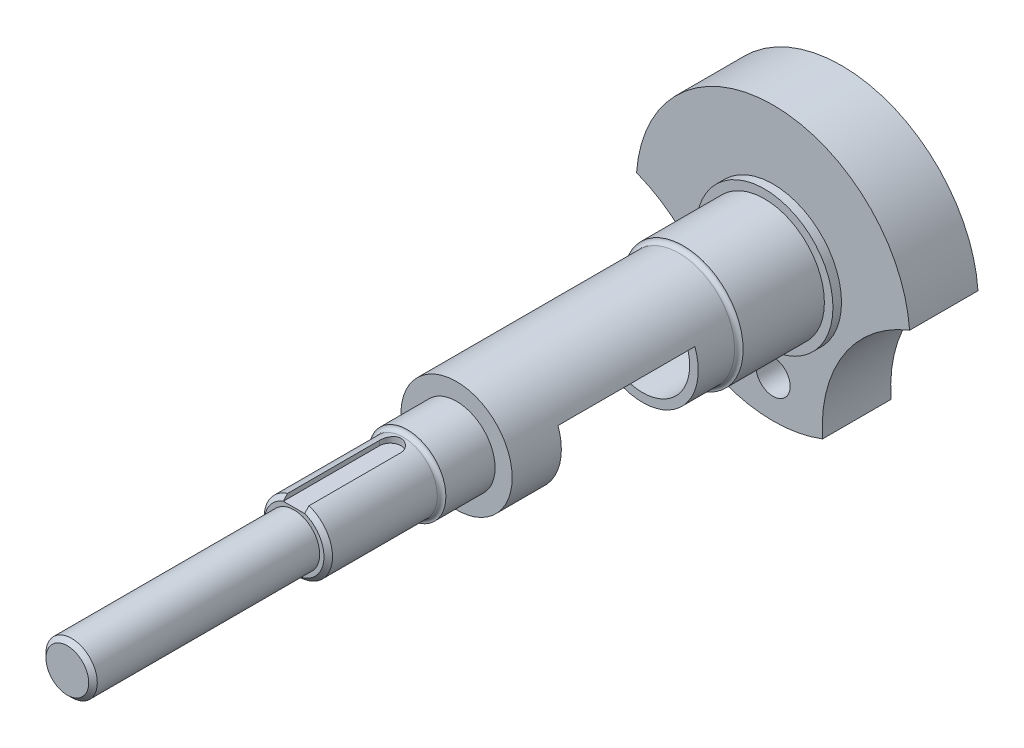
ISO-10303-21;
HEADER;
FILE_DESCRIPTION(('STEP AP214'),'2;1');
FILE_NAME('part.step','',(''),(''),'','','');
FILE_SCHEMA(('AUTOMOTIVE_DESIGN { 1 0 10303 214 1 1 1 1 }'));
ENDSEC;
DATA;
#1=APPLICATION_CONTEXT('core data for automotive mechanical design processes');
#2=APPLICATION_PROTOCOL_DEFINITION('international standard','automotive_design',2000,#1);
#3=PRODUCT_CONTEXT('',#1,'mechanical');
#4=PRODUCT('Part','Part','',(#3));
#5=PRODUCT_RELATED_PRODUCT_CATEGORY('part','',(#4));
#6=PRODUCT_DEFINITION_FORMATION('','',#4);
#7=PRODUCT_DEFINITION_CONTEXT('part definition',#1,'design');
#8=PRODUCT_DEFINITION('design','',#6,#7);
#9=PRODUCT_DEFINITION_SHAPE('','',#8);
#10=(LENGTH_UNIT() NAMED_UNIT(*) SI_UNIT(.MILLI.,.METRE.));
#11=(NAMED_UNIT(*) PLANE_ANGLE_UNIT() SI_UNIT($,.RADIAN.));
#12=(NAMED_UNIT(*) SI_UNIT($,.STERADIAN.) SOLID_ANGLE_UNIT());
#13=UNCERTAINTY_MEASURE_WITH_UNIT(LENGTH_MEASURE(1.E-05),#10,'distance_accuracy_value','');
#14=(GEOMETRIC_REPRESENTATION_CONTEXT(3) GLOBAL_UNCERTAINTY_ASSIGNED_CONTEXT((#13)) GLOBAL_UNIT_ASSIGNED_CONTEXT((#10,
#11,#12)) REPRESENTATION_CONTEXT('',''));
#15=CARTESIAN_POINT('',(0.,0.,0.));
#16=DIRECTION('',(0.,0.,1.));
#17=DIRECTION('',(1.,0.,0.));
#18=AXIS2_PLACEMENT_3D('',#15,#16,#17);
#19=CARTESIAN_POINT('',(0.,0.,64.));
#20=DIRECTION('',(0.,0.,-1.));
#21=DIRECTION('',(-1.,0.,0.));
#22=AXIS2_PLACEMENT_3D('',#19,#20,#21);
#23=CYLINDRICAL_SURFACE('',#22,4.);
#24=CARTESIAN_POINT('',(0.,0.,51.25));
#25=DIRECTION('',(0.,0.,1.));
#26=DIRECTION('',(1.,0.,0.));
#27=AXIS2_PLACEMENT_3D('',#24,#25,#26);
#28=CIRCLE('',#27,4.);
#29=CARTESIAN_POINT('',(4.,0.,51.25));
#30=VERTEX_POINT('',#29);
#31=EDGE_CURVE('E257',#30,#30,#28,.T.);
#32=ORIENTED_EDGE('',*,*,#31,.T.);
#33=EDGE_LOOP('',(#32));
#34=FACE_BOUND('',#33,.T.);
#35=DIRECTION('',(0.,0.,-1.));
#36=VECTOR('',#35,1.);
#37=CARTESIAN_POINT('',(-1.24999999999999,3.79967103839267,64.));
#38=LINE('',#37,#36);
#39=CARTESIAN_POINT('',(-1.24999999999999,3.79967103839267,52.75));
#40=VERTEX_POINT('',#39);
#41=CARTESIAN_POINT('',(-1.24999999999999,3.79967103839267,63.5));
#42=VERTEX_POINT('',#41);
#43=EDGE_CURVE('E167',#40,#42,#38,.F.);
#44=ORIENTED_EDGE('',*,*,#43,.F.);
#45=CARTESIAN_POINT('',(1.25,3.79967103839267,52.75));
#46=CARTESIAN_POINT('',(1.25000079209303,3.79966794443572,52.7157573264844));
#47=CARTESIAN_POINT('',(1.24859202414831,3.80013451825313,52.681531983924));
#48=CARTESIAN_POINT('',(1.24297859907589,3.80197544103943,52.6133440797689));
#49=CARTESIAN_POINT('',(1.23877461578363,3.80334957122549,52.5793814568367));
#50=CARTESIAN_POINT('',(1.22204347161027,3.80877341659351,52.4784451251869));
#51=CARTESIAN_POINT('',(1.20539672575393,3.81412503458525,52.4121759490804));
#52=CARTESIAN_POINT('',(1.16170105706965,3.82765800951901,52.2835553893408));
#53=CARTESIAN_POINT('',(1.13465653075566,3.83583817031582,52.2212023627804));
#54=CARTESIAN_POINT('',(1.07098191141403,3.85410064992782,52.1018698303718));
#55=CARTESIAN_POINT('',(1.03434683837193,3.86418395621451,52.0448931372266));
#56=CARTESIAN_POINT('',(0.951196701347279,3.88550108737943,51.9360211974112));
#57=CARTESIAN_POINT('',(0.904410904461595,3.89676086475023,51.8843378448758));
#58=CARTESIAN_POINT('',(0.80286383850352,3.91894210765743,51.7894056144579));
#59=CARTESIAN_POINT('',(0.748101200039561,3.92986351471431,51.7461581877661));
#60=CARTESIAN_POINT('',(0.630624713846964,3.95043574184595,51.6683880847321));
#61=CARTESIAN_POINT('',(0.567759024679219,3.96005223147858,51.6340849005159));
#62=CARTESIAN_POINT('',(0.436801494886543,3.97662579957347,51.5766230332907));
#63=CARTESIAN_POINT('',(0.368711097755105,3.98358360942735,51.5534612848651));
#64=CARTESIAN_POINT('',(0.231465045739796,3.99387170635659,51.5196490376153));
#65=CARTESIAN_POINT('',(0.162407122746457,3.99730732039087,51.5086344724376));
#66=CARTESIAN_POINT('',(0.023342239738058,4.0005359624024,51.4982756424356));
#67=CARTESIAN_POINT('',(-0.0466645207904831,4.00032974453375,51.4989289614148));
#68=CARTESIAN_POINT('',(-0.183074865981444,3.99637115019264,51.5116483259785));
#69=CARTESIAN_POINT('',(-0.249519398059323,3.99274146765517,51.5233195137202));
#70=CARTESIAN_POINT('',(-0.379453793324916,3.98249474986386,51.5570952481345));
#71=CARTESIAN_POINT('',(-0.442943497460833,3.97587755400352,51.5792003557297));
#72=CARTESIAN_POINT('',(-0.566078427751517,3.96023455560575,51.6334703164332));
#73=CARTESIAN_POINT('',(-0.625667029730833,3.95118023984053,51.6657550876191));
#74=CARTESIAN_POINT('',(-0.738703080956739,3.93161711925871,51.7393715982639));
#75=CARTESIAN_POINT('',(-0.792149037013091,3.92110796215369,51.7807055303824));
#76=CARTESIAN_POINT('',(-0.89373293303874,3.89923772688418,51.8732690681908));
#77=CARTESIAN_POINT('',(-0.94155771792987,3.88785939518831,51.9248387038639));
#78=CARTESIAN_POINT('',(-1.02798269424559,3.86590811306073,52.0353851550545));
#79=CARTESIAN_POINT('',(-1.06658010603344,3.85533540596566,52.0943641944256));
#80=CARTESIAN_POINT('',(-1.13382462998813,3.83610264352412,52.2189514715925));
#81=CARTESIAN_POINT('',(-1.16235013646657,3.82746639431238,52.2846291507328));
#82=CARTESIAN_POINT('',(-1.20780456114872,3.81336907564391,52.4201559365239));
#83=CARTESIAN_POINT('',(-1.22475139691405,3.80790310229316,52.4899984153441));
#84=CARTESIAN_POINT('',(-1.24039171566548,3.8028211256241,52.5920875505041));
#85=CARTESIAN_POINT('',(-1.24399403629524,3.80164270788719,52.6235724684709));
#86=CARTESIAN_POINT('',(-1.24879622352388,3.80006741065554,52.6866994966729));
#87=CARTESIAN_POINT('',(-1.2499994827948,3.79966942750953,52.7183413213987));
#88=CARTESIAN_POINT('',(-1.25,3.79967103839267,52.75));
#89=B_SPLINE_CURVE_WITH_KNOTS('',3,(#45,#46,#47,#48,#49,#50,#51,#52,#53,#54,#55,#56,#57,#58,#59,
#60,#61,#62,#63,#64,#65,#66,#67,#68,#69,#70,#71,#72,#73,#74,#75,#76,#77,#78,#79,#80,#81,#82,#83,
#84,#85,#86,#87,#88),.UNSPECIFIED.,.F.,.F.,(4,2,2,2,2,2,2,2,2,2,2,2,2,2,2,2,2,2,2,2,2,4),(0.,
0.102661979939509,0.205299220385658,0.409842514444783,0.614299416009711,0.818862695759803,
1.02975828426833,1.24069012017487,1.45639343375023,1.672037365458,1.88102599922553,
2.08997135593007,2.29170187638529,2.49344324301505,2.69765601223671,2.90191831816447,
3.11467479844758,3.32749528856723,3.54280388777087,3.75777854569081,3.85283052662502,
3.94774799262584),.UNSPECIFIED.);
#90=CARTESIAN_POINT('',(1.25000000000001,3.79967103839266,52.75));
#91=VERTEX_POINT('',#90);
#92=EDGE_CURVE('E11',#91,#40,#89,.T.);
#93=ORIENTED_EDGE('',*,*,#92,.F.);
#94=DIRECTION('',(0.,0.,-1.));
#95=VECTOR('',#94,1.);
#96=CARTESIAN_POINT('',(1.25000000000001,3.79967103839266,64.));
#97=LINE('',#96,#95);
#98=CARTESIAN_POINT('',(1.25000000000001,3.79967103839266,63.5));
#99=VERTEX_POINT('',#98);
#100=EDGE_CURVE('E144',#99,#91,#97,.T.);
#101=ORIENTED_EDGE('',*,*,#100,.F.);
#102=CARTESIAN_POINT('',(0.,0.,63.5));
#103=DIRECTION('',(0.,0.,1.));
#104=DIRECTION('',(1.,0.,0.));
#105=AXIS2_PLACEMENT_3D('',#102,#103,#104);
#106=CIRCLE('',#105,4.);
#107=EDGE_CURVE('E263',#99,#42,#106,.F.);
#108=ORIENTED_EDGE('',*,*,#107,.T.);
#109=EDGE_LOOP('',(#44,#93,#101,#108));
#110=FACE_BOUND('',#109,.T.);
#111=ADVANCED_FACE('F32',(#34,#110),#23,.T.);
#112=CARTESIAN_POINT('',(0.,0.,64.));
#113=DIRECTION('',(0.,0.,1.));
#114=DIRECTION('',(1.,0.,0.));
#115=AXIS2_PLACEMENT_3D('',#112,#113,#114);
#116=PLANE('',#115);
#117=CARTESIAN_POINT('',(0.,0.,64.));
#118=DIRECTION('',(0.,0.,1.));
#119=DIRECTION('',(1.,0.,0.));
#120=AXIS2_PLACEMENT_3D('',#117,#118,#119);
#121=CIRCLE('',#120,3.);
#122=CARTESIAN_POINT('',(3.,0.,64.));
#123=VERTEX_POINT('',#122);
#124=EDGE_CURVE('E198',#123,#123,#121,.T.);
#125=ORIENTED_EDGE('',*,*,#124,.F.);
#126=EDGE_LOOP('',(#125));
#127=FACE_BOUND('',#126,.T.);
#128=DIRECTION('',(1.,0.,0.));
#129=VECTOR('',#128,1.);
#130=CARTESIAN_POINT('',(-1.24999999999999,3.25,64.));
#131=LINE('',#130,#129);
#132=CARTESIAN_POINT('',(-1.24999999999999,3.25,64.));
#133=VERTEX_POINT('',#132);
#134=CARTESIAN_POINT('',(1.25000000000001,3.25,64.));
#135=VERTEX_POINT('',#134);
#136=EDGE_CURVE('E153',#133,#135,#131,.T.);
#137=ORIENTED_EDGE('',*,*,#136,.F.);
#138=DIRECTION('',(0.,-1.,0.));
#139=VECTOR('',#138,1.);
#140=CARTESIAN_POINT('',(-1.24999999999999,16.,64.));
#141=LINE('',#140,#139);
#142=CARTESIAN_POINT('',(-1.24999999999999,3.26917420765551,64.));
#143=VERTEX_POINT('',#142);
#144=EDGE_CURVE('E145',#143,#133,#141,.T.);
#145=ORIENTED_EDGE('',*,*,#144,.F.);
#146=CARTESIAN_POINT('',(0.,0.,64.));
#147=DIRECTION('',(0.,0.,1.));
#148=DIRECTION('',(1.,0.,0.));
#149=AXIS2_PLACEMENT_3D('',#146,#147,#148);
#150=CIRCLE('',#149,3.5);
#151=CARTESIAN_POINT('',(1.25000000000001,3.2691742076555,64.));
#152=VERTEX_POINT('',#151);
#153=EDGE_CURVE('E260',#143,#152,#150,.T.);
#154=ORIENTED_EDGE('',*,*,#153,.T.);
#155=DIRECTION('',(0.,-1.,0.));
#156=VECTOR('',#155,1.);
#157=CARTESIAN_POINT('',(1.25000000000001,16.,64.));
#158=LINE('',#157,#156);
#159=EDGE_CURVE('E52',#152,#135,#158,.T.);
#160=ORIENTED_EDGE('',*,*,#159,.T.);
#161=EDGE_LOOP('',(#137,#145,#154,#160));
#162=FACE_BOUND('',#161,.T.);
#163=ADVANCED_FACE('F340',(#127,#162),#116,.T.);
#164=CARTESIAN_POINT('',(0.,0.,64.));
#165=DIRECTION('',(0.,0.,-1.));
#166=DIRECTION('',(-1.,0.,0.));
#167=AXIS2_PLACEMENT_3D('',#164,#165,#166);
#168=CONICAL_SURFACE('',#167,3.5,0.785398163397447);
#169=ORIENTED_EDGE('',*,*,#153,.F.);
#170=CARTESIAN_POINT('',(-1.24999999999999,2.31268771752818,64.8711172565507));
#171=CARTESIAN_POINT('',(-1.24999999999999,2.4216466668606,64.7752059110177));
#172=CARTESIAN_POINT('',(-1.24999999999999,2.52990010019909,64.6785026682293));
#173=CARTESIAN_POINT('',(-1.24999999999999,2.7453015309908,64.4838820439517));
#174=CARTESIAN_POINT('',(-1.24999999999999,2.85244958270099,64.3859647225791));
#175=CARTESIAN_POINT('',(-1.24999999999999,3.06594399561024,64.1892876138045));
#176=CARTESIAN_POINT('',(-1.24999999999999,3.17229044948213,64.0905279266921));
#177=CARTESIAN_POINT('',(-1.24999999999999,3.38437756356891,63.89235760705));
#178=CARTESIAN_POINT('',(-1.24999999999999,3.49011821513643,63.7929469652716));
#179=CARTESIAN_POINT('',(-1.24999999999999,3.8066204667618,63.4940017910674));
#180=CARTESIAN_POINT('',(-1.24999999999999,4.01668672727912,63.2937314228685));
#181=CARTESIAN_POINT('',(-1.24999999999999,4.33091671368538,62.9923973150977));
#182=CARTESIAN_POINT('',(-1.24999999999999,4.43552139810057,62.8917917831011));
#183=CARTESIAN_POINT('',(-1.24999999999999,4.6444839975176,62.6903263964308));
#184=CARTESIAN_POINT('',(-1.24999999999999,4.74884191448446,62.5894665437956));
#185=CARTESIAN_POINT('',(-1.24999999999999,4.85310093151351,62.4885043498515));
#186=B_SPLINE_CURVE_WITH_KNOTS('',3,(#170,#171,#172,#173,#174,#175,#176,#177,#178,#179,#180,
#181,#182,#183,#184,#185),.UNSPECIFIED.,.F.,.F.,(4,2,2,2,2,2,2,4),(0.,0.435463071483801,
0.870904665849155,1.30629512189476,1.74169177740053,2.61238542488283,3.04778455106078,
3.48318019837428),.UNSPECIFIED.);
#187=EDGE_CURVE('E45',#143,#42,#186,.T.);
#188=ORIENTED_EDGE('',*,*,#187,.T.);
#189=ORIENTED_EDGE('',*,*,#107,.F.);
#190=CARTESIAN_POINT('',(1.25000000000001,4.8531009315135,62.4885043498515));
#191=CARTESIAN_POINT('',(1.25000000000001,4.74884191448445,62.5894665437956));
#192=CARTESIAN_POINT('',(1.25000000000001,4.64448399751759,62.6903263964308));
#193=CARTESIAN_POINT('',(1.25000000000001,4.43552139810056,62.8917917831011));
#194=CARTESIAN_POINT('',(1.25000000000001,4.33091671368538,62.9923973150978));
#195=CARTESIAN_POINT('',(1.25000000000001,4.01668672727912,63.2937314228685));
#196=CARTESIAN_POINT('',(1.25000000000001,3.80662046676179,63.4940017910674));
#197=CARTESIAN_POINT('',(1.25000000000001,3.49011821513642,63.7929469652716));
#198=CARTESIAN_POINT('',(1.25000000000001,3.3843775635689,63.89235760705));
#199=CARTESIAN_POINT('',(1.25000000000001,3.17229044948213,64.0905279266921));
#200=CARTESIAN_POINT('',(1.25000000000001,3.06594399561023,64.1892876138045));
#201=CARTESIAN_POINT('',(1.25000000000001,2.85244958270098,64.3859647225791));
#202=CARTESIAN_POINT('',(1.25000000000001,2.74530153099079,64.4838820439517));
#203=CARTESIAN_POINT('',(1.25000000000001,2.52990010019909,64.6785026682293));
#204=CARTESIAN_POINT('',(1.25000000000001,2.42164666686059,64.7752059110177));
#205=CARTESIAN_POINT('',(1.25000000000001,2.31268771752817,64.8711172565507));
#206=B_SPLINE_CURVE_WITH_KNOTS('',3,(#190,#191,#192,#193,#194,#195,#196,#197,#198,#199,#200,
#201,#202,#203,#204,#205),.UNSPECIFIED.,.F.,.F.,(4,2,2,2,2,2,2,4),(0.,0.435395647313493,
0.870794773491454,1.74148842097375,2.17688507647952,2.61227553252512,3.04771712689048,
3.48318019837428),.UNSPECIFIED.);
#207=EDGE_CURVE('E284',#99,#152,#206,.T.);
#208=ORIENTED_EDGE('',*,*,#207,.T.);
#209=EDGE_LOOP('',(#169,#188,#189,#208));
#210=FACE_BOUND('',#209,.T.);
#211=ADVANCED_FACE('F293',(#210),#168,.T.);
#212=CARTESIAN_POINT('',(0.,0.,8.));
#213=DIRECTION('',(0.,0.,-1.));
#214=DIRECTION('',(-1.,0.,0.));
#215=AXIS2_PLACEMENT_3D('',#212,#213,#214);
#216=CYLINDRICAL_SURFACE('',#215,16.);
#217=CARTESIAN_POINT('',(0.,0.,0.));
#218=DIRECTION('',(0.,0.,1.));
#219=DIRECTION('',(1.,0.,0.));
#220=AXIS2_PLACEMENT_3D('',#217,#218,#219);
#221=CIRCLE('',#220,16.);
#222=CARTESIAN_POINT('',(-5.79244601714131,-14.9146763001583,0.));
#223=VERTEX_POINT('',#222);
#224=CARTESIAN_POINT('',(5.79244601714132,-14.9146763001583,0.));
#225=VERTEX_POINT('',#224);
#226=EDGE_CURVE('E222',#223,#225,#221,.T.);
#227=ORIENTED_EDGE('',*,*,#226,.T.);
#228=DIRECTION('',(0.,0.,-1.));
#229=VECTOR('',#228,1.);
#230=CARTESIAN_POINT('',(5.79244601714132,-14.9146763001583,8.));
#231=LINE('',#230,#229);
#232=CARTESIAN_POINT('',(5.79244601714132,-14.9146763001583,8.));
#233=VERTEX_POINT('',#232);
#234=EDGE_CURVE('E251',#233,#225,#231,.T.);
#235=ORIENTED_EDGE('',*,*,#234,.F.);
#236=CARTESIAN_POINT('',(0.,0.,8.));
#237=DIRECTION('',(0.,0.,1.));
#238=DIRECTION('',(1.,0.,0.));
#239=AXIS2_PLACEMENT_3D('',#236,#237,#238);
#240=CIRCLE('',#239,16.);
#241=CARTESIAN_POINT('',(-5.79244601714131,-14.9146763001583,8.));
#242=VERTEX_POINT('',#241);
#243=EDGE_CURVE('E225',#242,#233,#240,.T.);
#244=ORIENTED_EDGE('',*,*,#243,.F.);
#245=DIRECTION('',(0.,0.,-1.));
#246=VECTOR('',#245,1.);
#247=CARTESIAN_POINT('',(-5.79244601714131,-14.9146763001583,8.));
#248=LINE('',#247,#246);
#249=EDGE_CURVE('E235',#242,#223,#248,.T.);
#250=ORIENTED_EDGE('',*,*,#249,.T.);
#251=EDGE_LOOP('',(#227,#235,#244,#250));
#252=FACE_BOUND('',#251,.T.);
#253=ADVANCED_FACE('F389',(#252),#216,.T.);
#254=CARTESIAN_POINT('',(21.75,-13.75,8.));
#255=DIRECTION('',(0.,0.,-1.));
#256=DIRECTION('',(-1.,0.,0.));
#257=AXIS2_PLACEMENT_3D('',#254,#255,#256);
#258=CYLINDRICAL_SURFACE('',#257,16.);
#259=CARTESIAN_POINT('',(21.75,-13.75,0.));
#260=DIRECTION('',(0.,0.,-1.));
#261=DIRECTION('',(-1.,0.,0.));
#262=AXIS2_PLACEMENT_3D('',#259,#260,#261);
#263=CIRCLE('',#262,16.);
#264=CARTESIAN_POINT('',(15.9575539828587,1.1646763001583,0.));
#265=VERTEX_POINT('',#264);
#266=EDGE_CURVE('E238',#225,#265,#263,.T.);
#267=ORIENTED_EDGE('',*,*,#266,.T.);
#268=DIRECTION('',(0.,0.,-1.));
#269=VECTOR('',#268,1.);
#270=CARTESIAN_POINT('',(15.9575539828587,1.1646763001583,8.));
#271=LINE('',#270,#269);
#272=CARTESIAN_POINT('',(15.9575539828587,1.1646763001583,8.));
#273=VERTEX_POINT('',#272);
#274=EDGE_CURVE('E248',#273,#265,#271,.T.);
#275=ORIENTED_EDGE('',*,*,#274,.F.);
#276=CARTESIAN_POINT('',(21.75,-13.75,8.));
#277=DIRECTION('',(0.,0.,-1.));
#278=DIRECTION('',(-1.,0.,0.));
#279=AXIS2_PLACEMENT_3D('',#276,#277,#278);
#280=CIRCLE('',#279,16.);
#281=EDGE_CURVE('E228',#233,#273,#280,.T.);
#282=ORIENTED_EDGE('',*,*,#281,.F.);
#283=ORIENTED_EDGE('',*,*,#234,.T.);
#284=EDGE_LOOP('',(#267,#275,#282,#283));
#285=FACE_BOUND('',#284,.T.);
#286=ADVANCED_FACE('F385',(#285),#258,.F.);
#287=CARTESIAN_POINT('',(0.,0.,8.));
#288=DIRECTION('',(0.,0.,-1.));
#289=DIRECTION('',(-1.,0.,0.));
#290=AXIS2_PLACEMENT_3D('',#287,#288,#289);
#291=CYLINDRICAL_SURFACE('',#290,16.);
#292=CARTESIAN_POINT('',(0.,0.,0.));
#293=DIRECTION('',(0.,0.,1.));
#294=DIRECTION('',(1.,0.,0.));
#295=AXIS2_PLACEMENT_3D('',#292,#293,#294);
#296=CIRCLE('',#295,16.);
#297=CARTESIAN_POINT('',(-15.9575539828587,1.16467630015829,0.));
#298=VERTEX_POINT('',#297);
#299=EDGE_CURVE('E240',#265,#298,#296,.T.);
#300=ORIENTED_EDGE('',*,*,#299,.T.);
#301=DIRECTION('',(0.,0.,-1.));
#302=VECTOR('',#301,1.);
#303=CARTESIAN_POINT('',(-15.9575539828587,1.16467630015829,8.));
#304=LINE('',#303,#302);
#305=CARTESIAN_POINT('',(-15.9575539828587,1.16467630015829,8.));
#306=VERTEX_POINT('',#305);
#307=EDGE_CURVE('E245',#306,#298,#304,.T.);
#308=ORIENTED_EDGE('',*,*,#307,.F.);
#309=CARTESIAN_POINT('',(0.,0.,8.));
#310=DIRECTION('',(0.,0.,1.));
#311=DIRECTION('',(1.,0.,0.));
#312=AXIS2_PLACEMENT_3D('',#309,#310,#311);
#313=CIRCLE('',#312,16.);
#314=EDGE_CURVE('E231',#273,#306,#313,.T.);
#315=ORIENTED_EDGE('',*,*,#314,.F.);
#316=ORIENTED_EDGE('',*,*,#274,.T.);
#317=EDGE_LOOP('',(#300,#308,#315,#316));
#318=FACE_BOUND('',#317,.T.);
#319=ADVANCED_FACE('F381',(#318),#291,.T.);
#320=CARTESIAN_POINT('',(-21.75,-13.75,8.));
#321=DIRECTION('',(0.,0.,-1.));
#322=DIRECTION('',(-1.,0.,0.));
#323=AXIS2_PLACEMENT_3D('',#320,#321,#322);
#324=CYLINDRICAL_SURFACE('',#323,16.);
#325=CARTESIAN_POINT('',(-21.75,-13.75,0.));
#326=DIRECTION('',(0.,0.,-1.));
#327=DIRECTION('',(1.,0.,0.));
#328=AXIS2_PLACEMENT_3D('',#325,#326,#327);
#329=CIRCLE('',#328,16.);
#330=EDGE_CURVE('E229',#298,#223,#329,.T.);
#331=ORIENTED_EDGE('',*,*,#330,.T.);
#332=ORIENTED_EDGE('',*,*,#249,.F.);
#333=CARTESIAN_POINT('',(-21.75,-13.75,8.));
#334=DIRECTION('',(0.,0.,-1.));
#335=DIRECTION('',(1.,0.,0.));
#336=AXIS2_PLACEMENT_3D('',#333,#334,#335);
#337=CIRCLE('',#336,16.);
#338=EDGE_CURVE('E233',#306,#242,#337,.T.);
#339=ORIENTED_EDGE('',*,*,#338,.F.);
#340=ORIENTED_EDGE('',*,*,#307,.T.);
#341=EDGE_LOOP('',(#331,#332,#339,#340));
#342=FACE_BOUND('',#341,.T.);
#343=ADVANCED_FACE('F374',(#342),#324,.F.);
#344=CARTESIAN_POINT('',(10.875,-6.875,8.));
#345=DIRECTION('',(0.,0.,1.));
#346=DIRECTION('',(1.,0.,0.));
#347=AXIS2_PLACEMENT_3D('',#344,#345,#346);
#348=PLANE('',#347);
#349=CARTESIAN_POINT('',(0.,-11.5,8.));
#350=DIRECTION('',(0.,0.,1.));
#351=DIRECTION('',(1.,0.,0.));
#352=AXIS2_PLACEMENT_3D('',#349,#350,#351);
#353=CIRCLE('',#352,2.);
#354=CARTESIAN_POINT('',(2.,-11.5,8.));
#355=VERTEX_POINT('',#354);
#356=EDGE_CURVE('E194',#355,#355,#353,.T.);
#357=ORIENTED_EDGE('',*,*,#356,.F.);
#358=EDGE_LOOP('',(#357));
#359=FACE_BOUND('',#358,.T.);
#360=CARTESIAN_POINT('',(0.,0.,8.));
#361=DIRECTION('',(0.,0.,1.));
#362=DIRECTION('',(1.,0.,0.));
#363=AXIS2_PLACEMENT_3D('',#360,#361,#362);
#364=CIRCLE('',#363,8.);
#365=CARTESIAN_POINT('',(8.,0.,8.));
#366=VERTEX_POINT('',#365);
#367=EDGE_CURVE('E216',#366,#366,#364,.T.);
#368=ORIENTED_EDGE('',*,*,#367,.F.);
#369=EDGE_LOOP('',(#368));
#370=FACE_BOUND('',#369,.T.);
#371=ORIENTED_EDGE('',*,*,#243,.T.);
#372=ORIENTED_EDGE('',*,*,#281,.T.);
#373=ORIENTED_EDGE('',*,*,#314,.T.);
#374=ORIENTED_EDGE('',*,*,#338,.T.);
#375=EDGE_LOOP('',(#371,#372,#373,#374));
#376=FACE_BOUND('',#375,.T.);
#377=ADVANCED_FACE('F371',(#359,#370,#376),#348,.T.);
#378=CARTESIAN_POINT('',(10.875,-6.875,0.));
#379=DIRECTION('',(0.,0.,1.));
#380=DIRECTION('',(1.,0.,0.));
#381=AXIS2_PLACEMENT_3D('',#378,#379,#380);
#382=PLANE('',#381);
#383=CARTESIAN_POINT('',(0.,0.,0.));
#384=DIRECTION('',(0.,0.,-1.));
#385=DIRECTION('',(-1.,0.,0.));
#386=AXIS2_PLACEMENT_3D('',#383,#384,#385);
#387=CIRCLE('',#386,5.49999999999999);
#388=CARTESIAN_POINT('',(-5.49999999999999,0.,0.));
#389=VERTEX_POINT('',#388);
#390=EDGE_CURVE('E191',#389,#389,#387,.T.);
#391=ORIENTED_EDGE('',*,*,#390,.F.);
#392=EDGE_LOOP('',(#391));
#393=FACE_BOUND('',#392,.T.);
#394=CARTESIAN_POINT('',(0.,-11.5,0.));
#395=DIRECTION('',(0.,0.,1.));
#396=DIRECTION('',(1.,0.,0.));
#397=AXIS2_PLACEMENT_3D('',#394,#395,#396);
#398=CIRCLE('',#397,2.);
#399=CARTESIAN_POINT('',(2.,-11.5,0.));
#400=VERTEX_POINT('',#399);
#401=EDGE_CURVE('E195',#400,#400,#398,.T.);
#402=ORIENTED_EDGE('',*,*,#401,.T.);
#403=EDGE_LOOP('',(#402));
#404=FACE_BOUND('',#403,.T.);
#405=ORIENTED_EDGE('',*,*,#226,.F.);
#406=ORIENTED_EDGE('',*,*,#330,.F.);
#407=ORIENTED_EDGE('',*,*,#299,.F.);
#408=ORIENTED_EDGE('',*,*,#266,.F.);
#409=EDGE_LOOP('',(#405,#406,#407,#408));
#410=FACE_BOUND('',#409,.T.);
#411=ADVANCED_FACE('F369',(#393,#404,#410),#382,.F.);
#412=CARTESIAN_POINT('',(0.,0.,9.));
#413=DIRECTION('',(0.,0.,-1.));
#414=DIRECTION('',(-1.,0.,0.));
#415=AXIS2_PLACEMENT_3D('',#412,#413,#414);
#416=CYLINDRICAL_SURFACE('',#415,8.);
#417=CARTESIAN_POINT('',(0.,0.,9.));
#418=DIRECTION('',(0.,0.,1.));
#419=DIRECTION('',(1.,0.,0.));
#420=AXIS2_PLACEMENT_3D('',#417,#418,#419);
#421=CIRCLE('',#420,8.);
#422=CARTESIAN_POINT('',(8.,0.,9.));
#423=VERTEX_POINT('',#422);
#424=EDGE_CURVE('E219',#423,#423,#421,.T.);
#425=ORIENTED_EDGE('',*,*,#424,.F.);
#426=EDGE_LOOP('',(#425));
#427=FACE_BOUND('',#426,.T.);
#428=ORIENTED_EDGE('',*,*,#367,.T.);
#429=EDGE_LOOP('',(#428));
#430=FACE_BOUND('',#429,.T.);
#431=ADVANCED_FACE('F365',(#427,#430),#416,.T.);
#432=CARTESIAN_POINT('',(0.,0.,9.));
#433=DIRECTION('',(0.,0.,1.));
#434=DIRECTION('',(1.,0.,0.));
#435=AXIS2_PLACEMENT_3D('',#432,#433,#434);
#436=PLANE('',#435);
#437=CARTESIAN_POINT('',(0.,0.,9.));
#438=DIRECTION('',(0.,0.,1.));
#439=DIRECTION('',(1.,0.,0.));
#440=AXIS2_PLACEMENT_3D('',#437,#438,#439);
#441=CIRCLE('',#440,7.);
#442=CARTESIAN_POINT('',(7.,0.,9.));
#443=VERTEX_POINT('',#442);
#444=EDGE_CURVE('E212',#443,#443,#441,.T.);
#445=ORIENTED_EDGE('',*,*,#444,.F.);
#446=EDGE_LOOP('',(#445));
#447=FACE_BOUND('',#446,.T.);
#448=ORIENTED_EDGE('',*,*,#424,.T.);
#449=EDGE_LOOP('',(#448));
#450=FACE_BOUND('',#449,.T.);
#451=ADVANCED_FACE('F361',(#447,#450),#436,.T.);
#452=CARTESIAN_POINT('',(0.,0.,18.5));
#453=DIRECTION('',(0.,0.,-1.));
#454=DIRECTION('',(-1.,0.,0.));
#455=AXIS2_PLACEMENT_3D('',#452,#453,#454);
#456=CYLINDRICAL_SURFACE('',#455,7.);
#457=CARTESIAN_POINT('',(0.,0.,18.5));
#458=DIRECTION('',(0.,0.,1.));
#459=DIRECTION('',(1.,0.,0.));
#460=AXIS2_PLACEMENT_3D('',#457,#458,#459);
#461=CIRCLE('',#460,7.);
#462=CARTESIAN_POINT('',(7.,0.,18.5));
#463=VERTEX_POINT('',#462);
#464=EDGE_CURVE('E213',#463,#463,#461,.T.);
#465=ORIENTED_EDGE('',*,*,#464,.F.);
#466=EDGE_LOOP('',(#465));
#467=FACE_BOUND('',#466,.T.);
#468=ORIENTED_EDGE('',*,*,#444,.T.);
#469=EDGE_LOOP('',(#468));
#470=FACE_BOUND('',#469,.T.);
#471=ADVANCED_FACE('F357',(#467,#470),#456,.T.);
#472=CARTESIAN_POINT('',(0.,0.,45.));
#473=DIRECTION('',(0.,0.,-1.));
#474=DIRECTION('',(-1.,0.,0.));
#475=AXIS2_PLACEMENT_3D('',#472,#473,#474);
#476=CYLINDRICAL_SURFACE('',#475,6.5);
#477=CARTESIAN_POINT('',(0.,0.,39.25));
#478=DIRECTION('',(0.,0.,1.));
#479=DIRECTION('',(1.,0.,0.));
#480=AXIS2_PLACEMENT_3D('',#477,#478,#479);
#481=CIRCLE('',#480,6.5);
#482=CARTESIAN_POINT('',(-2.2200391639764,-6.10912646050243,39.25));
#483=VERTEX_POINT('',#482);
#484=CARTESIAN_POINT('',(6.10912646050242,2.22003916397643,39.25));
#485=VERTEX_POINT('',#484);
#486=EDGE_CURVE('E182',#483,#485,#481,.T.);
#487=ORIENTED_EDGE('',*,*,#486,.T.);
#488=DIRECTION('',(0.,0.,-1.));
#489=VECTOR('',#488,1.);
#490=CARTESIAN_POINT('',(6.10912646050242,2.22003916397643,45.));
#491=LINE('',#490,#489);
#492=CARTESIAN_POINT('',(6.10912646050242,2.22003916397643,23.25));
#493=VERTEX_POINT('',#492);
#494=EDGE_CURVE('E179',#485,#493,#491,.T.);
#495=ORIENTED_EDGE('',*,*,#494,.T.);
#496=CARTESIAN_POINT('',(0.,0.,23.25));
#497=DIRECTION('',(0.,0.,-1.));
#498=DIRECTION('',(0.,1.,0.));
#499=AXIS2_PLACEMENT_3D('',#496,#497,#498);
#500=CIRCLE('',#499,6.5);
#501=CARTESIAN_POINT('',(-2.2200391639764,-6.10912646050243,23.25));
#502=VERTEX_POINT('',#501);
#503=EDGE_CURVE('E185',#493,#502,#500,.T.);
#504=ORIENTED_EDGE('',*,*,#503,.T.);
#505=DIRECTION('',(0.,0.,-1.));
#506=VECTOR('',#505,1.);
#507=CARTESIAN_POINT('',(-2.2200391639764,-6.10912646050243,45.));
#508=LINE('',#507,#506);
#509=EDGE_CURVE('E176',#502,#483,#508,.F.);
#510=ORIENTED_EDGE('',*,*,#509,.T.);
#511=EDGE_LOOP('',(#487,#495,#504,#510));
#512=FACE_BOUND('',#511,.T.);
#513=CARTESIAN_POINT('',(0.,0.,19.));
#514=DIRECTION('',(0.,0.,1.));
#515=DIRECTION('',(1.,0.,0.));
#516=AXIS2_PLACEMENT_3D('',#513,#514,#515);
#517=CIRCLE('',#516,6.5);
#518=CARTESIAN_POINT('',(6.5,0.,19.));
#519=VERTEX_POINT('',#518);
#520=EDGE_CURVE('E254',#519,#519,#517,.T.);
#521=ORIENTED_EDGE('',*,*,#520,.T.);
#522=EDGE_LOOP('',(#521));
#523=FACE_BOUND('',#522,.T.);
#524=CARTESIAN_POINT('',(0.,0.,45.));
#525=DIRECTION('',(0.,0.,1.));
#526=DIRECTION('',(1.,0.,0.));
#527=AXIS2_PLACEMENT_3D('',#524,#525,#526);
#528=CIRCLE('',#527,6.5);
#529=CARTESIAN_POINT('',(6.5,0.,45.));
#530=VERTEX_POINT('',#529);
#531=EDGE_CURVE('E207',#530,#530,#528,.T.);
#532=ORIENTED_EDGE('',*,*,#531,.F.);
#533=EDGE_LOOP('',(#532));
#534=FACE_BOUND('',#533,.T.);
#535=ADVANCED_FACE('F353',(#512,#523,#534),#476,.T.);
#536=CARTESIAN_POINT('',(0.,0.,45.));
#537=DIRECTION('',(0.,0.,1.));
#538=DIRECTION('',(1.,0.,0.));
#539=AXIS2_PLACEMENT_3D('',#536,#537,#538);
#540=PLANE('',#539);
#541=CARTESIAN_POINT('',(0.,0.,45.));
#542=DIRECTION('',(0.,0.,1.));
#543=DIRECTION('',(1.,0.,0.));
#544=AXIS2_PLACEMENT_3D('',#541,#542,#543);
#545=CIRCLE('',#544,4.5);
#546=CARTESIAN_POINT('',(4.5,0.,45.));
#547=VERTEX_POINT('',#546);
#548=EDGE_CURVE('E203',#547,#547,#545,.T.);
#549=ORIENTED_EDGE('',*,*,#548,.F.);
#550=EDGE_LOOP('',(#549));
#551=FACE_BOUND('',#550,.T.);
#552=ORIENTED_EDGE('',*,*,#531,.T.);
#553=EDGE_LOOP('',(#552));
#554=FACE_BOUND('',#553,.T.);
#555=ADVANCED_FACE('F349',(#551,#554),#540,.T.);
#556=CARTESIAN_POINT('',(0.,0.,50.75));
#557=DIRECTION('',(0.,0.,-1.));
#558=DIRECTION('',(-1.,0.,0.));
#559=AXIS2_PLACEMENT_3D('',#556,#557,#558);
#560=CYLINDRICAL_SURFACE('',#559,4.5);
#561=CARTESIAN_POINT('',(0.,0.,50.75));
#562=DIRECTION('',(0.,0.,1.));
#563=DIRECTION('',(1.,0.,0.));
#564=AXIS2_PLACEMENT_3D('',#561,#562,#563);
#565=CIRCLE('',#564,4.5);
#566=CARTESIAN_POINT('',(4.5,0.,50.75));
#567=VERTEX_POINT('',#566);
#568=EDGE_CURVE('E204',#567,#567,#565,.T.);
#569=ORIENTED_EDGE('',*,*,#568,.F.);
#570=EDGE_LOOP('',(#569));
#571=FACE_BOUND('',#570,.T.);
#572=ORIENTED_EDGE('',*,*,#548,.T.);
#573=EDGE_LOOP('',(#572));
#574=FACE_BOUND('',#573,.T.);
#575=ADVANCED_FACE('F338',(#571,#574),#560,.T.);
#576=CARTESIAN_POINT('',(0.,0.,90.5));
#577=DIRECTION('',(0.,0.,-1.));
#578=DIRECTION('',(-1.,0.,0.));
#579=AXIS2_PLACEMENT_3D('',#576,#577,#578);
#580=CYLINDRICAL_SURFACE('',#579,3.);
#581=CARTESIAN_POINT('',(0.,0.,90.));
#582=DIRECTION('',(0.,0.,1.));
#583=DIRECTION('',(1.,0.,0.));
#584=AXIS2_PLACEMENT_3D('',#581,#582,#583);
#585=CIRCLE('',#584,3.);
#586=CARTESIAN_POINT('',(3.,0.,90.));
#587=VERTEX_POINT('',#586);
#588=EDGE_CURVE('E269',#587,#587,#585,.F.);
#589=ORIENTED_EDGE('',*,*,#588,.T.);
#590=EDGE_LOOP('',(#589));
#591=FACE_BOUND('',#590,.T.);
#592=ORIENTED_EDGE('',*,*,#124,.T.);
#593=EDGE_LOOP('',(#592));
#594=FACE_BOUND('',#593,.T.);
#595=ADVANCED_FACE('F334',(#591,#594),#580,.T.);
#596=CARTESIAN_POINT('',(0.,0.,90.5));
#597=DIRECTION('',(0.,0.,1.));
#598=DIRECTION('',(1.,0.,0.));
#599=AXIS2_PLACEMENT_3D('',#596,#597,#598);
#600=PLANE('',#599);
#601=CARTESIAN_POINT('',(0.,0.,90.5));
#602=DIRECTION('',(0.,0.,1.));
#603=DIRECTION('',(1.,0.,0.));
#604=AXIS2_PLACEMENT_3D('',#601,#602,#603);
#605=CIRCLE('',#604,2.5);
#606=CARTESIAN_POINT('',(2.5,0.,90.5));
#607=VERTEX_POINT('',#606);
#608=EDGE_CURVE('E266',#607,#607,#605,.T.);
#609=ORIENTED_EDGE('',*,*,#608,.T.);
#610=EDGE_LOOP('',(#609));
#611=FACE_BOUND('',#610,.T.);
#612=ADVANCED_FACE('F330',(#611),#600,.T.);
#613=CARTESIAN_POINT('',(0.,-11.5,0.));
#614=DIRECTION('',(0.,0.,1.));
#615=DIRECTION('',(1.,0.,0.));
#616=AXIS2_PLACEMENT_3D('',#613,#614,#615);
#617=CYLINDRICAL_SURFACE('',#616,2.);
#618=ORIENTED_EDGE('',*,*,#401,.F.);
#619=EDGE_LOOP('',(#618));
#620=FACE_BOUND('',#619,.T.);
#621=ORIENTED_EDGE('',*,*,#356,.T.);
#622=EDGE_LOOP('',(#621));
#623=FACE_BOUND('',#622,.T.);
#624=ADVANCED_FACE('F326',(#620,#623),#617,.F.);
#625=CARTESIAN_POINT('',(0.,0.,19.));
#626=DIRECTION('',(0.,0.,1.));
#627=DIRECTION('',(1.,0.,0.));
#628=AXIS2_PLACEMENT_3D('',#625,#626,#627);
#629=TOROIDAL_SURFACE('',#628,7.,0.5);
#630=ORIENTED_EDGE('',*,*,#464,.T.);
#631=EDGE_LOOP('',(#630));
#632=FACE_BOUND('',#631,.T.);
#633=ORIENTED_EDGE('',*,*,#520,.F.);
#634=EDGE_LOOP('',(#633));
#635=FACE_BOUND('',#634,.T.);
#636=ADVANCED_FACE('F329',(#632,#635),#629,.F.);
#637=CARTESIAN_POINT('',(0.,0.,51.25));
#638=DIRECTION('',(0.,0.,1.));
#639=DIRECTION('',(1.,0.,0.));
#640=AXIS2_PLACEMENT_3D('',#637,#638,#639);
#641=TOROIDAL_SURFACE('',#640,4.5,0.5);
#642=ORIENTED_EDGE('',*,*,#568,.T.);
#643=EDGE_LOOP('',(#642));
#644=FACE_BOUND('',#643,.T.);
#645=ORIENTED_EDGE('',*,*,#31,.F.);
#646=EDGE_LOOP('',(#645));
#647=FACE_BOUND('',#646,.T.);
#648=ADVANCED_FACE('F395',(#644,#647),#641,.F.);
#649=CARTESIAN_POINT('',(0.,0.,90.5));
#650=DIRECTION('',(0.,0.,-1.));
#651=DIRECTION('',(-1.,0.,0.));
#652=AXIS2_PLACEMENT_3D('',#649,#650,#651);
#653=CONICAL_SURFACE('',#652,2.5,0.785398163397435);
#654=ORIENTED_EDGE('',*,*,#588,.F.);
#655=EDGE_LOOP('',(#654));
#656=FACE_BOUND('',#655,.T.);
#657=ORIENTED_EDGE('',*,*,#608,.F.);
#658=EDGE_LOOP('',(#657));
#659=FACE_BOUND('',#658,.T.);
#660=ADVANCED_FACE('F34',(#656,#659),#653,.T.);
#661=CARTESIAN_POINT('',(0.,0.,0.));
#662=DIRECTION('',(0.,0.,-1.));
#663=DIRECTION('',(-1.,0.,0.));
#664=AXIS2_PLACEMENT_3D('',#661,#662,#663);
#665=CYLINDRICAL_SURFACE('',#664,5.49999999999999);
#666=CARTESIAN_POINT('',(0.,0.,23.25));
#667=DIRECTION('',(0.,0.,-1.));
#668=DIRECTION('',(0.,1.,0.));
#669=AXIS2_PLACEMENT_3D('',#666,#667,#668);
#670=CIRCLE('',#669,5.49999999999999);
#671=CARTESIAN_POINT('',(-1.42350474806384,-5.31259204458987,23.25));
#672=VERTEX_POINT('',#671);
#673=CARTESIAN_POINT('',(5.31259204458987,1.42350474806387,23.25));
#674=VERTEX_POINT('',#673);
#675=EDGE_CURVE('E278',#672,#674,#670,.F.);
#676=ORIENTED_EDGE('',*,*,#675,.T.);
#677=DIRECTION('',(0.,0.,-1.));
#678=VECTOR('',#677,1.);
#679=CARTESIAN_POINT('',(5.31259204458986,1.42350474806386,0.));
#680=LINE('',#679,#678);
#681=CARTESIAN_POINT('',(5.31259204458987,1.42350474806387,39.25));
#682=VERTEX_POINT('',#681);
#683=EDGE_CURVE('E281',#674,#682,#680,.F.);
#684=ORIENTED_EDGE('',*,*,#683,.T.);
#685=CARTESIAN_POINT('',(0.,0.,39.25));
#686=DIRECTION('',(0.,0.,1.));
#687=DIRECTION('',(1.,0.,0.));
#688=AXIS2_PLACEMENT_3D('',#685,#686,#687);
#689=CIRCLE('',#688,5.49999999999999);
#690=CARTESIAN_POINT('',(-1.42350474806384,-5.31259204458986,39.25));
#691=VERTEX_POINT('',#690);
#692=EDGE_CURVE('E275',#682,#691,#689,.F.);
#693=ORIENTED_EDGE('',*,*,#692,.T.);
#694=DIRECTION('',(0.,0.,-1.));
#695=VECTOR('',#694,1.);
#696=CARTESIAN_POINT('',(-1.42350474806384,-5.31259204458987,0.));
#697=LINE('',#696,#695);
#698=EDGE_CURVE('E272',#691,#672,#697,.T.);
#699=ORIENTED_EDGE('',*,*,#698,.T.);
#700=EDGE_LOOP('',(#676,#684,#693,#699));
#701=FACE_BOUND('',#700,.T.);
#702=CARTESIAN_POINT('',(0.,0.,40.));
#703=DIRECTION('',(0.,0.,-1.));
#704=DIRECTION('',(-1.,0.,0.));
#705=AXIS2_PLACEMENT_3D('',#702,#703,#704);
#706=CIRCLE('',#705,5.49999999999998);
#707=CARTESIAN_POINT('',(-5.49999999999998,0.,40.));
#708=VERTEX_POINT('',#707);
#709=EDGE_CURVE('E188',#708,#708,#706,.T.);
#710=ORIENTED_EDGE('',*,*,#709,.F.);
#711=EDGE_LOOP('',(#710));
#712=FACE_BOUND('',#711,.T.);
#713=ORIENTED_EDGE('',*,*,#390,.T.);
#714=EDGE_LOOP('',(#713));
#715=FACE_BOUND('',#714,.T.);
#716=ADVANCED_FACE('F321',(#701,#712,#715),#665,.F.);
#717=CARTESIAN_POINT('',(0.,0.,40.));
#718=DIRECTION('',(0.,0.,-1.));
#719=DIRECTION('',(-1.,0.,0.));
#720=AXIS2_PLACEMENT_3D('',#717,#718,#719);
#721=CONICAL_SURFACE('',#720,5.49999999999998,1.02974425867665);
#722=CARTESIAN_POINT('',(0.,0.,43.3047334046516));
#723=VERTEX_POINT('',#722);
#724=VERTEX_LOOP('',#723);
#725=FACE_BOUND('',#724,.T.);
#726=ORIENTED_EDGE('',*,*,#709,.T.);
#727=EDGE_LOOP('',(#726));
#728=FACE_BOUND('',#727,.T.);
#729=ADVANCED_FACE('F317',(#725,#728),#721,.F.);
#730=CARTESIAN_POINT('',(36.2727416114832,4.31518762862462,23.25));
#731=DIRECTION('',(0.,0.,-1.));
#732=DIRECTION('',(0.,1.,0.));
#733=AXIS2_PLACEMENT_3D('',#730,#731,#732);
#734=PLANE('',#733);
#735=DIRECTION('',(-0.707106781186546,-0.707106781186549,0.));
#736=VECTOR('',#735,1.);
#737=CARTESIAN_POINT('',(22.2385082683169,18.3494209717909,23.25));
#738=LINE('',#737,#736);
#739=EDGE_CURVE('E172',#493,#674,#738,.T.);
#740=ORIENTED_EDGE('',*,*,#739,.T.);
#741=ORIENTED_EDGE('',*,*,#675,.F.);
#742=EDGE_CURVE('E169',#672,#502,#738,.T.);
#743=ORIENTED_EDGE('',*,*,#742,.T.);
#744=ORIENTED_EDGE('',*,*,#503,.F.);
#745=EDGE_LOOP('',(#740,#741,#743,#744));
#746=FACE_BOUND('',#745,.T.);
#747=ADVANCED_FACE('F313',(#746),#734,.F.);
#748=CARTESIAN_POINT('',(36.2727416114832,4.31518762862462,39.25));
#749=DIRECTION('',(0.,0.,1.));
#750=DIRECTION('',(1.,0.,0.));
#751=AXIS2_PLACEMENT_3D('',#748,#749,#750);
#752=PLANE('',#751);
#753=DIRECTION('',(0.707106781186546,0.707106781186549,0.));
#754=VECTOR('',#753,1.);
#755=CARTESIAN_POINT('',(22.2385082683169,18.3494209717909,39.25));
#756=LINE('',#755,#754);
#757=EDGE_CURVE('E60',#483,#691,#756,.T.);
#758=ORIENTED_EDGE('',*,*,#757,.T.);
#759=ORIENTED_EDGE('',*,*,#692,.F.);
#760=EDGE_CURVE('E173',#682,#485,#756,.T.);
#761=ORIENTED_EDGE('',*,*,#760,.T.);
#762=ORIENTED_EDGE('',*,*,#486,.F.);
#763=EDGE_LOOP('',(#758,#759,#761,#762));
#764=FACE_BOUND('',#763,.T.);
#765=ADVANCED_FACE('F309',(#764),#752,.F.);
#766=CARTESIAN_POINT('',(22.2385082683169,18.3494209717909,23.25));
#767=DIRECTION('',(-0.707106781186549,0.707106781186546,0.));
#768=DIRECTION('',(-0.707106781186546,-0.707106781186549,0.));
#769=AXIS2_PLACEMENT_3D('',#766,#767,#768);
#770=PLANE('',#769);
#771=ORIENTED_EDGE('',*,*,#760,.F.);
#772=ORIENTED_EDGE('',*,*,#683,.F.);
#773=ORIENTED_EDGE('',*,*,#739,.F.);
#774=ORIENTED_EDGE('',*,*,#494,.F.);
#775=EDGE_LOOP('',(#771,#772,#773,#774));
#776=FACE_BOUND('',#775,.T.);
#777=ADVANCED_FACE('F306',(#776),#770,.F.);
#778=ORIENTED_EDGE('',*,*,#742,.F.);
#779=ORIENTED_EDGE('',*,*,#698,.F.);
#780=ORIENTED_EDGE('',*,*,#757,.F.);
#781=ORIENTED_EDGE('',*,*,#509,.F.);
#782=EDGE_LOOP('',(#778,#779,#780,#781));
#783=FACE_BOUND('',#782,.T.);
#784=ADVANCED_FACE('F305',(#783),#770,.F.);
#785=CARTESIAN_POINT('',(0.,16.,52.75));
#786=DIRECTION('',(0.,-1.,0.));
#787=DIRECTION('',(0.,0.,-1.));
#788=AXIS2_PLACEMENT_3D('',#785,#786,#787);
#789=CYLINDRICAL_SURFACE('',#788,1.25);
#790=ORIENTED_EDGE('',*,*,#92,.T.);
#791=DIRECTION('',(0.,-1.,0.));
#792=VECTOR('',#791,1.);
#793=CARTESIAN_POINT('',(-1.24999999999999,16.,52.75));
#794=LINE('',#793,#792);
#795=CARTESIAN_POINT('',(-1.24999999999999,3.25,52.75));
#796=VERTEX_POINT('',#795);
#797=EDGE_CURVE('E135',#40,#796,#794,.T.);
#798=ORIENTED_EDGE('',*,*,#797,.T.);
#799=CARTESIAN_POINT('',(0.,3.25,52.75));
#800=DIRECTION('',(0.,1.,0.));
#801=DIRECTION('',(0.,0.,1.));
#802=AXIS2_PLACEMENT_3D('',#799,#800,#801);
#803=CIRCLE('',#802,1.25);
#804=CARTESIAN_POINT('',(1.25000000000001,3.25,52.75));
#805=VERTEX_POINT('',#804);
#806=EDGE_CURVE('E140',#805,#796,#803,.T.);
#807=ORIENTED_EDGE('',*,*,#806,.F.);
#808=DIRECTION('',(0.,-1.,0.));
#809=VECTOR('',#808,1.);
#810=CARTESIAN_POINT('',(1.25000000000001,16.,52.75));
#811=LINE('',#810,#809);
#812=EDGE_CURVE('E162',#91,#805,#811,.T.);
#813=ORIENTED_EDGE('',*,*,#812,.F.);
#814=EDGE_LOOP('',(#790,#798,#807,#813));
#815=FACE_BOUND('',#814,.T.);
#816=ADVANCED_FACE('F137',(#815),#789,.F.);
#817=CARTESIAN_POINT('',(-1.24999999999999,16.,64.));
#818=DIRECTION('',(1.,0.,0.));
#819=DIRECTION('',(0.,0.,-1.));
#820=AXIS2_PLACEMENT_3D('',#817,#818,#819);
#821=PLANE('',#820);
#822=ORIENTED_EDGE('',*,*,#43,.T.);
#823=ORIENTED_EDGE('',*,*,#187,.F.);
#824=ORIENTED_EDGE('',*,*,#144,.T.);
#825=DIRECTION('',(0.,0.,1.));
#826=VECTOR('',#825,1.);
#827=CARTESIAN_POINT('',(-1.24999999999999,3.25,64.));
#828=LINE('',#827,#826);
#829=EDGE_CURVE('E148',#796,#133,#828,.T.);
#830=ORIENTED_EDGE('',*,*,#829,.F.);
#831=ORIENTED_EDGE('',*,*,#797,.F.);
#832=EDGE_LOOP('',(#822,#823,#824,#830,#831));
#833=FACE_BOUND('',#832,.T.);
#834=ADVANCED_FACE('F149',(#833),#821,.T.);
#835=CARTESIAN_POINT('',(1.25000000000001,16.,64.));
#836=DIRECTION('',(-1.,0.,0.));
#837=DIRECTION('',(0.,0.,1.));
#838=AXIS2_PLACEMENT_3D('',#835,#836,#837);
#839=PLANE('',#838);
#840=ORIENTED_EDGE('',*,*,#100,.T.);
#841=ORIENTED_EDGE('',*,*,#812,.T.);
#842=DIRECTION('',(0.,0.,-1.));
#843=VECTOR('',#842,1.);
#844=CARTESIAN_POINT('',(1.25000000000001,3.25,64.));
#845=LINE('',#844,#843);
#846=EDGE_CURVE('E157',#135,#805,#845,.T.);
#847=ORIENTED_EDGE('',*,*,#846,.F.);
#848=ORIENTED_EDGE('',*,*,#159,.F.);
#849=ORIENTED_EDGE('',*,*,#207,.F.);
#850=EDGE_LOOP('',(#840,#841,#847,#848,#849));
#851=FACE_BOUND('',#850,.T.);
#852=ADVANCED_FACE('F296',(#851),#839,.T.);
#853=CARTESIAN_POINT('',(0.,3.25,52.75));
#854=DIRECTION('',(0.,1.,0.));
#855=DIRECTION('',(0.,0.,1.));
#856=AXIS2_PLACEMENT_3D('',#853,#854,#855);
#857=PLANE('',#856);
#858=ORIENTED_EDGE('',*,*,#806,.T.);
#859=ORIENTED_EDGE('',*,*,#829,.T.);
#860=ORIENTED_EDGE('',*,*,#136,.T.);
#861=ORIENTED_EDGE('',*,*,#846,.T.);
#862=EDGE_LOOP('',(#858,#859,#860,#861));
#863=FACE_BOUND('',#862,.T.);
#864=ADVANCED_FACE('F156',(#863),#857,.T.);
#865=CLOSED_SHELL('',(#111,#163,#211,#253,#286,#319,#343,#377,#411,#431,#451,#471,#535,#555,
#575,#595,#612,#624,#636,#648,#660,#716,#729,#747,#765,#777,#784,#816,#834,#852,#864));
#866=MANIFOLD_SOLID_BREP('B2',#865);
#867=ADVANCED_BREP_SHAPE_REPRESENTATION('',(#18,#866),#14);
#868=SHAPE_DEFINITION_REPRESENTATION(#9,#867);
ENDSEC;
END-ISO-10303-21;
